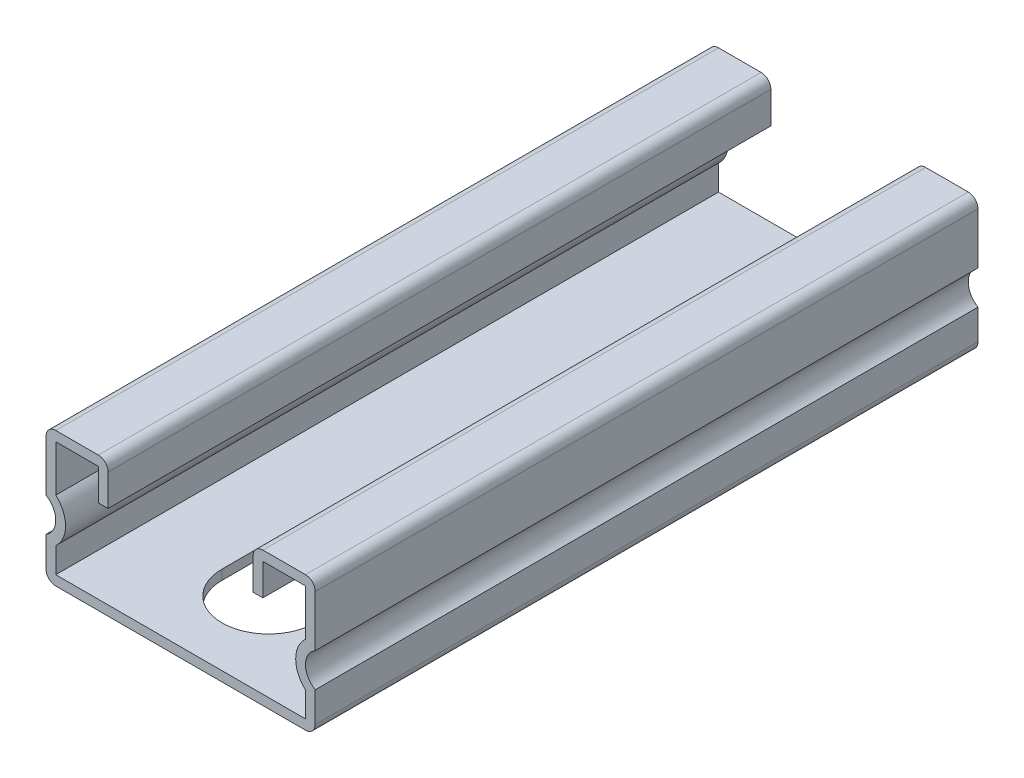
from build123d import *

# Parameters (mm, degrees)
BASE_EXTRUDE_DEPTH = 101.6
SLOT_DEPTH         = 118.113754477
LPATTERN1_COUNT    = 2
LPATTERN1_PITCH    = 50.8


with BuildPart() as part:
    # Sketch1 → Base-Extrude (new body)
    with BuildSketch(Plane.XY):
        with BuildLine():
            Line((-20.6375, 10.4394), (-20.6375, 2.59565134))
            ThreePointArc((-20.6375, 2.59565134), (-19.1389, 0), (-20.6375, -2.59565134))
            Line((-20.6375, -2.59565134), (-20.6375, -7.2136))
            ThreePointArc((-20.6375, -7.2136), (-20.198570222, -8.273270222), (-19.1389, -8.7122))
            Line((-19.1389, -8.7122), (19.1389, -8.7122))
            ThreePointArc((19.1389, -8.7122), (20.198570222, -8.273270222), (20.6375, -7.2136))
            Line((20.6375, -7.2136), (20.6375, -2.59565134))
            ThreePointArc((20.6375, -2.59565134), (19.1389, 0), (20.6375, 2.59565134))
            Line((20.6375, 2.59565134), (20.6375, 10.4394))
            ThreePointArc((20.6375, 10.4394), (20.198570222, 11.499070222), (19.1389, 11.938))
            Line((19.1389, 11.938), (12.6111, 11.938))
            ThreePointArc((12.6111, 11.938), (11.551429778, 11.499070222), (11.1125, 10.4394))
            Line((11.1125, 10.4394), (11.1125, 5.588))
            Line((11.1125, 5.588), (12.6111, 5.588))
            Line((12.6111, 5.588), (12.6111, 10.4394))
            Line((12.6111, 10.4394), (19.1389, 10.4394))
            Line((19.1389, 10.4394), (19.1389, 3.350971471))
            ThreePointArc((19.1389, 3.350971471), (17.6403, 0), (19.1389, -3.350971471))
            Line((19.1389, -3.350971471), (19.1389, -7.2136))
            Line((19.1389, -7.2136), (-19.1389, -7.2136))
            Line((-19.1389, -7.2136), (-19.1389, -3.350971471))
            ThreePointArc((-19.1389, -3.350971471), (-17.6403, 0), (-19.1389, 3.350971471))
            Line((-19.1389, 3.350971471), (-19.1389, 10.4394))
            Line((-19.1389, 10.4394), (-12.6111, 10.4394))
            Line((-12.6111, 10.4394), (-12.6111, 5.588))
            Line((-12.6111, 5.588), (-11.1125, 5.588))
            Line((-11.1125, 5.588), (-11.1125, 10.4394))
            ThreePointArc((-11.1125, 10.4394), (-11.551429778, 11.499070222), (-12.6111, 11.938))
            Line((-12.6111, 11.938), (-19.1389, 11.938))
            ThreePointArc((-19.1389, 11.938), (-20.198570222, 11.499070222), (-20.6375, 10.4394))
        make_face()
    extrude(amount=BASE_EXTRUDE_DEPTH)

    # Sketch2 → Slot (cut, through all)
    with BuildSketch(Plane(origin=(-0.747608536, -8.7122, -11.677878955), x_dir=(1, 0, 0), z_dir=(0, -1, 0))):
        with BuildLine():
            Line((7.891358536, 48.984128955), (7.891358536, 34.696628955))
            ThreePointArc((7.891358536, 34.696628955), (0.747608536, 27.552878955), (-6.396141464, 34.696628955))
            Line((-6.396141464, 34.696628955), (-6.396141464, 48.984128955))
            ThreePointArc((-6.396141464, 48.984128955), (0.747608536, 56.127878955), (7.891358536, 48.984128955))
        make_face()
    slot = extrude(amount=-SLOT_DEPTH, mode=Mode.SUBTRACT)

    # LPattern1: Slot ×2
    with Locations(*[(0, 0, i * LPATTERN1_PITCH) for i in range(1, LPATTERN1_COUNT)]):
        add(slot, mode=Mode.SUBTRACT)


solid = part.part
